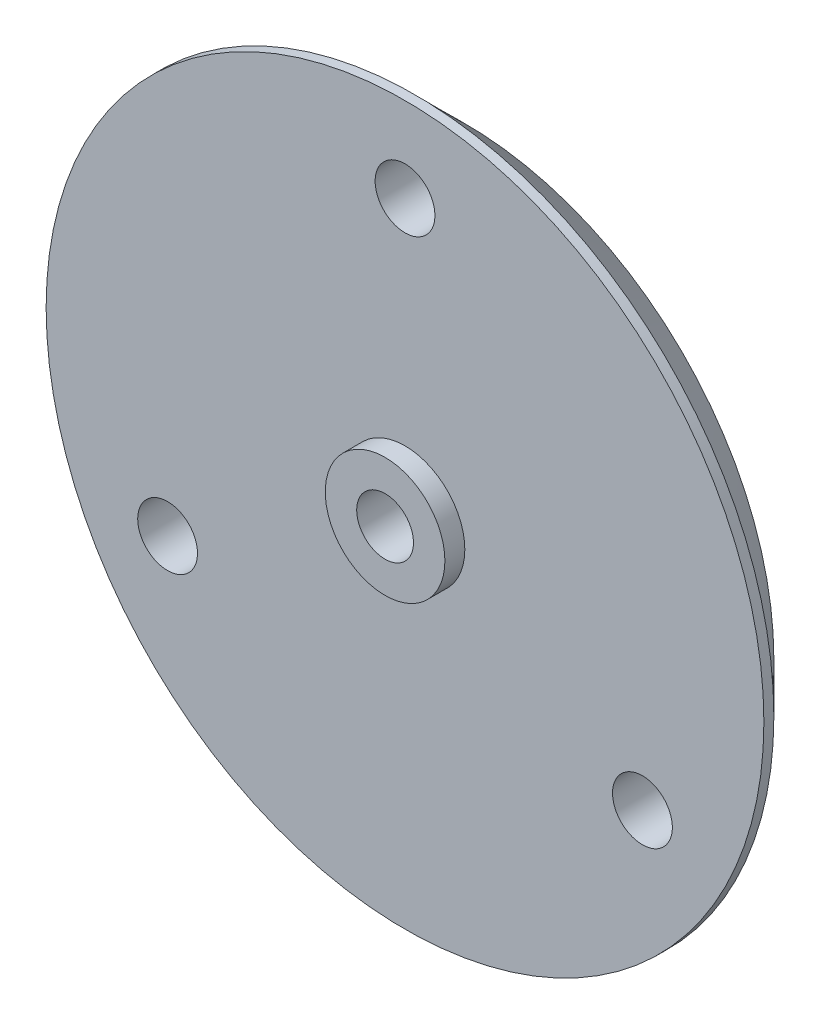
from build123d import *

# Parameters (mm, degrees)
ESQUISSE1_R                  = 18
EXTRUSION1_DEPTH             = 3
CHANFREIN1_SIZE              = 2.5
ESQUISSE2_R                  = 11.95
ESQUISSE2_R_2                = 10.95
ESQUISSE2_R_3                = 8.95
ESQUISSE2_R_4                = 7.95
ESQUISSE2_R_5                = 6.95
ESQUISSE2_R_6                = 5.95
ESQUISSE2_R_7                = 4.95
ESQUISSE2_R_8                = 3.95
ENL_V_MAT_EXTRU_1_DEPTH      = 1.6
ESQUISSE3_R                  = 1.5
ENL_V_MAT_EXTRU_2_DEPTH      = 26.632011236
R_P_TITION_CIRCULAIRE1_COUNT = 3
ESQUISSE5_R                  = 3
EXTRUSION2_DEPTH             = 1
ESQUISSE6_R                  = 1.425
ENL_V_MAT_EXTRU_3_DEPTH      = 26.768197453


with BuildPart() as part:
    # Esquisse1 → Extrusion1 (new body)
    with BuildSketch(Plane.XY):
        Circle(ESQUISSE1_R)
    extrude(amount=EXTRUSION1_DEPTH)

    # Chanfrein1
    chanfrein1_edges = [part.edges().sort_by_distance(p)[0] for p in [
        (-18, 0, 0),
    ]]
    chamfer(chanfrein1_edges, length=CHANFREIN1_SIZE)

    # Esquisse2 → Enl_v. mat.-Extru.1 (cut)
    # profile 1 of 4: a face of its own
    with BuildSketch(Plane(origin=(0, 0, 0), x_dir=(-1, 0, 0), z_dir=(0, 0, -1))):
        Circle(ESQUISSE2_R)
        Circle(ESQUISSE2_R_2, mode=Mode.SUBTRACT)
    # profile 2 of 4: a face of its own
    with BuildSketch(Plane(origin=(0, 0, 0), x_dir=(-1, 0, 0), z_dir=(0, 0, -1))):
        Circle(ESQUISSE2_R_3)
        Circle(ESQUISSE2_R_4, mode=Mode.SUBTRACT)
    # profile 3 of 4: a face of its own
    with BuildSketch(Plane(origin=(0, 0, 0), x_dir=(-1, 0, 0), z_dir=(0, 0, -1))):
        Circle(ESQUISSE2_R_5)
        Circle(ESQUISSE2_R_6, mode=Mode.SUBTRACT)
    # profile 4 of 4: a face of its own
    with BuildSketch(Plane(origin=(0, 0, 0), x_dir=(-1, 0, 0), z_dir=(0, 0, -1))):
        Circle(ESQUISSE2_R_7)
        Circle(ESQUISSE2_R_8, mode=Mode.SUBTRACT)
    extrude(amount=-ENL_V_MAT_EXTRU_1_DEPTH, mode=Mode.SUBTRACT)

    # Esquisse3 → Enl_v. mat.-Extru.2 (cut, through all)
    with BuildSketch(Plane(origin=(0, 0, 0), x_dir=(-1, 0, 0), z_dir=(0, 0, -1))):
        with Locations((0, 13.75)):
            Circle(ESQUISSE3_R)
    enl_v_mat_extru_2 = extrude(amount=-ENL_V_MAT_EXTRU_2_DEPTH, mode=Mode.SUBTRACT)

    # R_p_tition circulaire1: Enl_v. mat.-Extru.2 ×3 about axis
    r_p_tition_circulaire1_axis = Axis((0, 0, 0), (0, 0, 1))
    for i in range(1, R_P_TITION_CIRCULAIRE1_COUNT):
        add(enl_v_mat_extru_2.rotate(r_p_tition_circulaire1_axis, i * 360 / R_P_TITION_CIRCULAIRE1_COUNT), mode=Mode.SUBTRACT)

    # Esquisse5 → Extrusion2 (add)
    with BuildSketch(Plane.XY.offset(3)):
        Circle(ESQUISSE5_R)
    extrude(amount=EXTRUSION2_DEPTH)

    # Esquisse6 → Enl_v. mat.-Extru.3 (cut, through all)
    with BuildSketch(Plane(origin=(0, 0, 0), x_dir=(-1, 0, 0), z_dir=(0, 0, -1))):
        Circle(ESQUISSE6_R)
    extrude(amount=-ENL_V_MAT_EXTRU_3_DEPTH, mode=Mode.SUBTRACT)


solid = part.part
